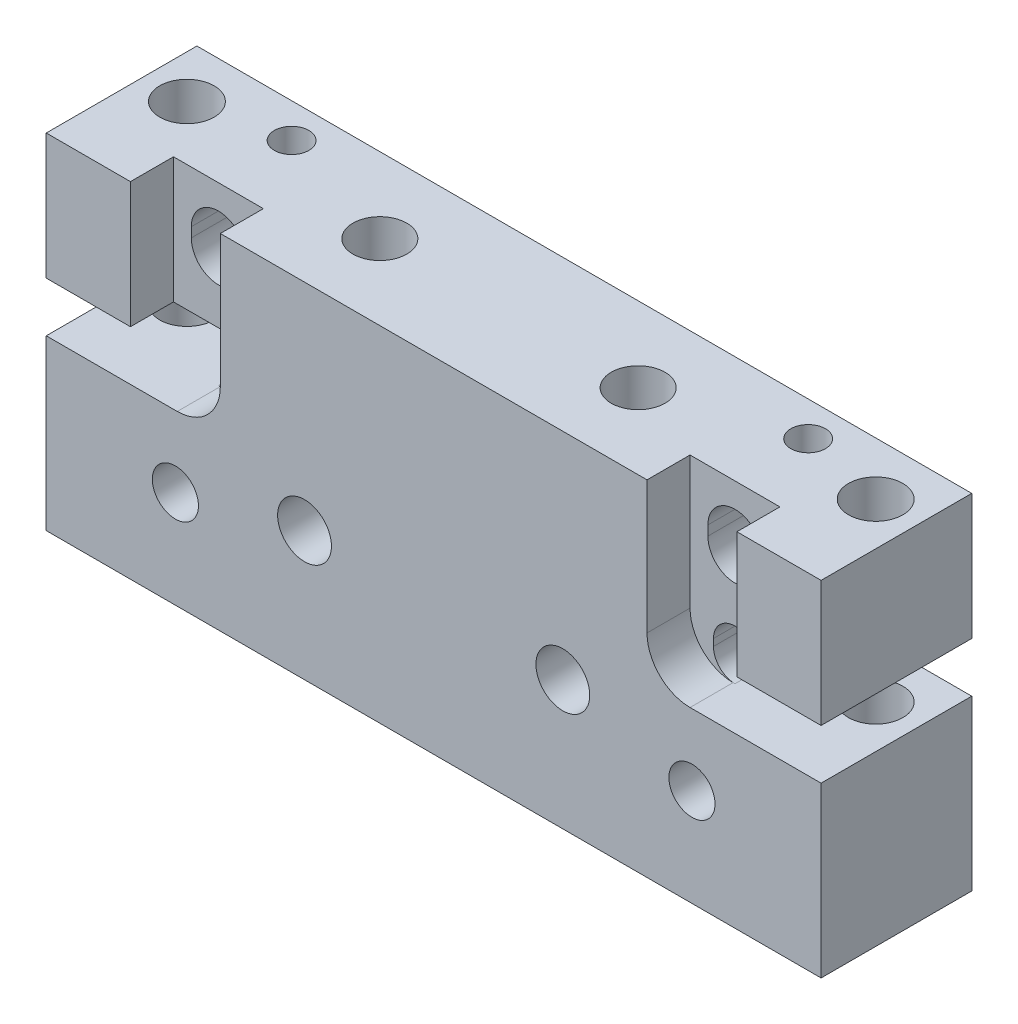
from build123d import *

# Parameters (mm, degrees)
SKETCH1_W                    = 114.3
SKETCH1_H                    = 50.8
EXTRUDE1_DEPTH               = 22.225
CLEARANCE_SLOT_DEPTH         = 128.039681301
M8X1_25_TAPPED_HOLE1_D       = 6.8
F_3_8_16_TAPPED_HOLE7_D      = 7.9375
CUT_EXTRUDE2_DEPTH           = 128.039681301
CUT_EXTRUDE3_DEPTH           = 6.35
F_3_8_16_TAPPED_HOLE6_D      = 7.9375
F_1_4_20_TAPPED_HOLE1_REACH  = 129.04
F_1_4_20_TAPPED_HOLE1_BORE_R = 2.5527
O_0_316_DIAMETER_HOLE3_D     = 8.0264


with BuildPart() as part:
    # Sketch1 → Extrude1 (new body)
    with BuildSketch(Plane.XY):
        with Locations((57.15, 25.4)):
            Rectangle(SKETCH1_W, SKETCH1_H)
    extrude(amount=EXTRUDE1_DEPTH)

    # Sketch2 → Clearance Slot (cut, through all)
    with BuildSketch(Plane.XY.offset(22.225)):
        with BuildLine():
            Line((114.3, 32.258), (95.25, 32.258))
            ThreePointArc((95.25, 32.258), (93.00493597, 31.32806403), (92.075, 29.083))
            Line((92.075, 29.083), (92.075, 28.067))
            ThreePointArc((92.075, 28.067), (93.00493597, 25.82193597), (95.25, 24.892))
            Line((95.25, 24.892), (114.3, 24.892))
            Line((114.3, 24.892), (114.3, 32.258))
        make_face()
        with BuildLine():
            Line((22.225, 29.083), (22.225, 28.067))
            ThreePointArc((22.225, 28.067), (21.29506403, 25.82193597), (19.05, 24.892))
            Line((19.05, 24.892), (0, 24.892))
            Line((0, 24.892), (0, 32.258))
            Line((0, 32.258), (19.05, 32.258))
            ThreePointArc((19.05, 32.258), (21.29506403, 31.32806403), (22.225, 29.083))
        make_face()
    extrude(amount=-CLEARANCE_SLOT_DEPTH, mode=Mode.SUBTRACT)

    # M8x1.25 Tapped Hole1 (through all)
    with Locations(Plane.XY.offset(22.225)):
        with Locations((95.25, 14.4), (19.05, 14.4)):
            Hole(M8X1_25_TAPPED_HOLE1_D / 2)

    # 3_8-16 Tapped Hole7 (through all)
    with Locations(Plane.XY.offset(22.225)):
        with Locations((38.1, 19.05), (76.2, 19.05)):
            Hole(F_3_8_16_TAPPED_HOLE7_D / 2)

    # Sketch10 → Cut-Extrude2 (cut, through all)
    with BuildSketch(Plane.XY.offset(22.225)):
        with BuildLine():
            Line((99.25, 41.75), (99.25, 43.18))
            ThreePointArc((99.25, 43.18), (95.25, 47.18), (91.25, 43.18))
            Line((91.25, 43.18), (91.25, 41.75))
            ThreePointArc((91.25, 41.75), (95.25, 37.75), (99.25, 41.75))
        make_face()
        with BuildLine():
            Line((23.05, 41.75), (23.05, 43.18))
            ThreePointArc((23.05, 43.18), (19.05, 47.18), (15.05, 43.18))
            Line((15.05, 43.18), (15.05, 41.75))
            ThreePointArc((15.05, 41.75), (19.05, 37.75), (23.05, 41.75))
        make_face()
    extrude(amount=-CUT_EXTRUDE2_DEPTH, mode=Mode.SUBTRACT)

    # Sketch11 → Cut-Extrude3 (cut)
    with BuildSketch(Plane.XY.offset(22.225)):
        with BuildLine():
            Line((88.6206, 50.8), (101.8794, 50.8))
            Line((101.8794, 50.8), (101.8794, 24.892))
            Line((101.8794, 24.892), (94.9706, 24.892))
            ThreePointArc((94.9706, 24.892), (90.480471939, 26.751871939), (88.6206, 31.242))
            Line((88.6206, 31.242), (88.6206, 50.8))
        make_face()
        with BuildLine():
            Line((12.4206, 50.8), (12.4206, 24.892))
            Line((12.4206, 24.892), (19.3294, 24.892))
            ThreePointArc((19.3294, 24.892), (23.819528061, 26.751871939), (25.6794, 31.242))
            Line((25.6794, 31.242), (25.6794, 50.8))
            Line((25.6794, 50.8), (12.4206, 50.8))
        make_face()
    extrude(amount=-CUT_EXTRUDE3_DEPTH, mode=Mode.SUBTRACT)

    # 3_8-16 Tapped Hole6 (through all)
    with Locations(Plane(origin=(0, 50.8, 0), x_dir=(-1, 0, 0), z_dir=(0, 1, 0))):
        with Locations((-76.2, 11.1125), (-38.1, 11.1125)):
            Hole(F_3_8_16_TAPPED_HOLE6_D / 2)

    # 1_4-20 Tapped Hole1 bore → 1_4-20 Tapped Hole1 (cut, up to next)
    with BuildSketch(Plane(origin=(0, 50.8, 0), x_dir=(-1, 0, 0), z_dir=(0, 1, 0)), mode=Mode.PRIVATE) as f_1_4_20_tapped_hole1_sk1:
        with Locations((-95.25, 5.08)):
            Circle(F_1_4_20_TAPPED_HOLE1_BORE_R)
    f_1_4_20_tapped_hole1_tool1 = extrude(f_1_4_20_tapped_hole1_sk1.sketch, amount=-F_1_4_20_TAPPED_HOLE1_REACH, mode=Mode.PRIVATE) & part.part
    # 1_4-20 Tapped Hole1 bore → 1_4-20 Tapped Hole1 (cut, up to next)
    with BuildSketch(Plane(origin=(0, 50.8, 0), x_dir=(-1, 0, 0), z_dir=(0, 1, 0)), mode=Mode.PRIVATE) as f_1_4_20_tapped_hole1_sk2:
        with Locations((-19.05, 5.08)):
            Circle(F_1_4_20_TAPPED_HOLE1_BORE_R)
    f_1_4_20_tapped_hole1_tool2 = extrude(f_1_4_20_tapped_hole1_sk2.sketch, amount=-F_1_4_20_TAPPED_HOLE1_REACH, mode=Mode.PRIVATE) & part.part
    add(f_1_4_20_tapped_hole1_tool1.solids().sort_by_distance((95.25, 50.8, 5.08))[0], mode=Mode.SUBTRACT)
    add(f_1_4_20_tapped_hole1_tool2.solids().sort_by_distance((19.05, 50.8, 5.08))[0], mode=Mode.SUBTRACT)

    # O _0.316_ Diameter Hole3 (through all)
    with Locations(Plane(origin=(0, 50.8, 0), x_dir=(-1, 0, 0), z_dir=(0, 1, 0))):
        with Locations((-6.35, 7.8232), (-107.95, 7.8232)):
            Hole(O_0_316_DIAMETER_HOLE3_D / 2)


solid = part.part
